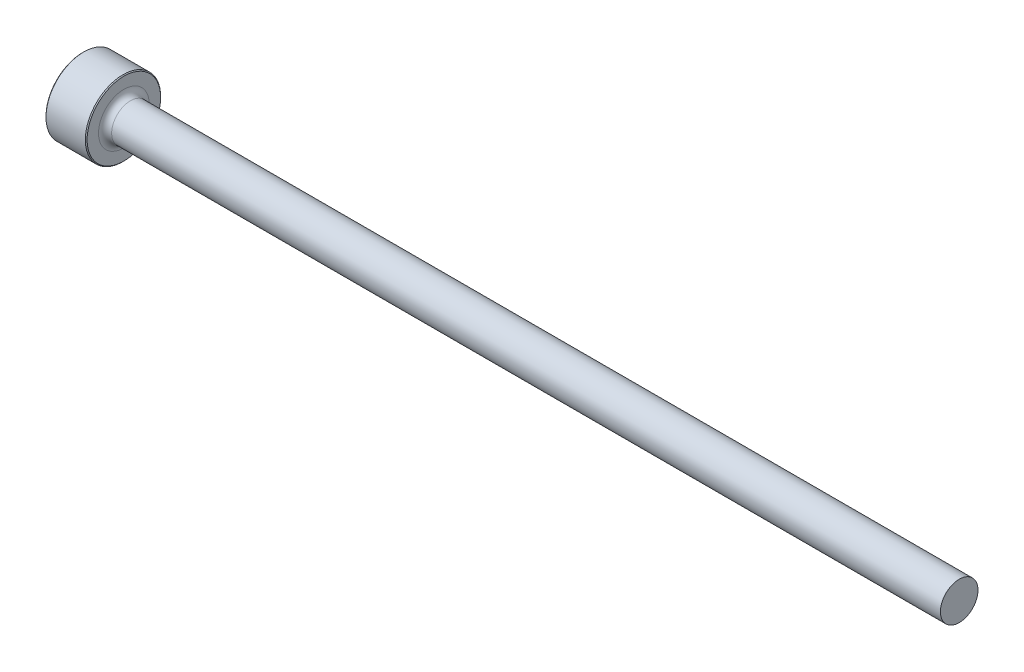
ISO-10303-21;
HEADER;
FILE_DESCRIPTION(('STEP AP214'),'2;1');
FILE_NAME('part.step','',(''),(''),'','','');
FILE_SCHEMA(('AUTOMOTIVE_DESIGN { 1 0 10303 214 1 1 1 1 }'));
ENDSEC;
DATA;
#1=APPLICATION_CONTEXT('core data for automotive mechanical design processes');
#2=APPLICATION_PROTOCOL_DEFINITION('international standard','automotive_design',2000,#1);
#3=PRODUCT_CONTEXT('',#1,'mechanical');
#4=PRODUCT('Part','Part','',(#3));
#5=PRODUCT_RELATED_PRODUCT_CATEGORY('part','',(#4));
#6=PRODUCT_DEFINITION_FORMATION('','',#4);
#7=PRODUCT_DEFINITION_CONTEXT('part definition',#1,'design');
#8=PRODUCT_DEFINITION('design','',#6,#7);
#9=PRODUCT_DEFINITION_SHAPE('','',#8);
#10=(LENGTH_UNIT() NAMED_UNIT(*) SI_UNIT(.MILLI.,.METRE.));
#11=(NAMED_UNIT(*) PLANE_ANGLE_UNIT() SI_UNIT($,.RADIAN.));
#12=(NAMED_UNIT(*) SI_UNIT($,.STERADIAN.) SOLID_ANGLE_UNIT());
#13=UNCERTAINTY_MEASURE_WITH_UNIT(LENGTH_MEASURE(1.E-05),#10,'distance_accuracy_value','');
#14=(GEOMETRIC_REPRESENTATION_CONTEXT(3) GLOBAL_UNCERTAINTY_ASSIGNED_CONTEXT((#13)) GLOBAL_UNIT_ASSIGNED_CONTEXT((#10,
#11,#12)) REPRESENTATION_CONTEXT('',''));
#15=CARTESIAN_POINT('',(0.,0.,0.));
#16=DIRECTION('',(0.,0.,1.));
#17=DIRECTION('',(1.,0.,0.));
#18=AXIS2_PLACEMENT_3D('',#15,#16,#17);
#19=CARTESIAN_POINT('',(101.6,2.17900249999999,0.));
#20=DIRECTION('',(1.,0.,0.));
#21=DIRECTION('',(0.,1.,0.));
#22=AXIS2_PLACEMENT_3D('',#19,#20,#21);
#23=PLANE('',#22);
#24=CARTESIAN_POINT('',(101.6,0.,0.));
#25=DIRECTION('',(1.,0.,0.));
#26=DIRECTION('',(0.,1.,0.));
#27=AXIS2_PLACEMENT_3D('',#24,#25,#26);
#28=CIRCLE('',#27,2.1790025);
#29=CARTESIAN_POINT('',(101.6,2.17900249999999,0.));
#30=VERTEX_POINT('',#29);
#31=EDGE_CURVE('E50',#30,#30,#28,.T.);
#32=ORIENTED_EDGE('',*,*,#31,.T.);
#33=EDGE_LOOP('',(#32));
#34=FACE_BOUND('',#33,.T.);
#35=ADVANCED_FACE('F30',(#34),#23,.T.);
#36=CARTESIAN_POINT('',(101.6,0.,0.));
#37=DIRECTION('',(1.,0.,0.));
#38=DIRECTION('',(0.,1.,0.));
#39=AXIS2_PLACEMENT_3D('',#36,#37,#38);
#40=CYLINDRICAL_SURFACE('',#39,2.1790025);
#41=CARTESIAN_POINT('',(5.5245,0.,0.));
#42=DIRECTION('',(1.,0.,0.));
#43=DIRECTION('',(0.,1.,0.));
#44=AXIS2_PLACEMENT_3D('',#41,#42,#43);
#45=CIRCLE('',#44,2.17900249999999);
#46=CARTESIAN_POINT('',(5.5245,2.17900249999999,0.));
#47=VERTEX_POINT('',#46);
#48=EDGE_CURVE('E53',#47,#47,#45,.T.);
#49=ORIENTED_EDGE('',*,*,#48,.T.);
#50=EDGE_LOOP('',(#49));
#51=FACE_BOUND('',#50,.T.);
#52=ORIENTED_EDGE('',*,*,#31,.F.);
#53=EDGE_LOOP('',(#52));
#54=FACE_BOUND('',#53,.T.);
#55=ADVANCED_FACE('F74',(#51,#54),#40,.T.);
#56=CARTESIAN_POINT('',(5.5245,0.,0.));
#57=DIRECTION('',(1.,0.,0.));
#58=DIRECTION('',(0.,1.,0.));
#59=AXIS2_PLACEMENT_3D('',#56,#57,#58);
#60=TOROIDAL_SURFACE('',#59,2.94100249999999,0.762);
#61=CARTESIAN_POINT('',(4.7625,0.,0.));
#62=DIRECTION('',(1.,0.,0.));
#63=DIRECTION('',(0.,1.,0.));
#64=AXIS2_PLACEMENT_3D('',#61,#62,#63);
#65=CIRCLE('',#64,2.94100249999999);
#66=CARTESIAN_POINT('',(4.7625,2.94100249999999,0.));
#67=VERTEX_POINT('',#66);
#68=EDGE_CURVE('E56',#67,#67,#65,.T.);
#69=ORIENTED_EDGE('',*,*,#68,.T.);
#70=EDGE_LOOP('',(#69));
#71=FACE_BOUND('',#70,.T.);
#72=ORIENTED_EDGE('',*,*,#48,.F.);
#73=EDGE_LOOP('',(#72));
#74=FACE_BOUND('',#73,.T.);
#75=ADVANCED_FACE('F60',(#71,#74),#60,.F.);
#76=CARTESIAN_POINT('',(4.7625,4.365625,0.));
#77=DIRECTION('',(1.,0.,0.));
#78=DIRECTION('',(0.,1.,0.));
#79=AXIS2_PLACEMENT_3D('',#76,#77,#78);
#80=PLANE('',#79);
#81=CARTESIAN_POINT('',(4.7625,0.,0.));
#82=DIRECTION('',(1.,0.,0.));
#83=DIRECTION('',(0.,1.,0.));
#84=AXIS2_PLACEMENT_3D('',#81,#82,#83);
#85=CIRCLE('',#84,4.26402499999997);
#86=CARTESIAN_POINT('',(4.7625,4.26402499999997,0.));
#87=VERTEX_POINT('',#86);
#88=EDGE_CURVE('E10',#87,#87,#85,.T.);
#89=ORIENTED_EDGE('',*,*,#88,.T.);
#90=EDGE_LOOP('',(#89));
#91=FACE_BOUND('',#90,.T.);
#92=ORIENTED_EDGE('',*,*,#68,.F.);
#93=EDGE_LOOP('',(#92));
#94=FACE_BOUND('',#93,.T.);
#95=ADVANCED_FACE('F63',(#91,#94),#80,.T.);
#96=CARTESIAN_POINT('',(101.6,0.,0.));
#97=DIRECTION('',(1.,0.,0.));
#98=DIRECTION('',(0.,1.,0.));
#99=AXIS2_PLACEMENT_3D('',#96,#97,#98);
#100=CYLINDRICAL_SURFACE('',#99,4.365625);
#101=CARTESIAN_POINT('',(0.101599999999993,0.,0.));
#102=DIRECTION('',(-1.,0.,0.));
#103=DIRECTION('',(0.,-1.,0.));
#104=AXIS2_PLACEMENT_3D('',#101,#102,#103);
#105=CIRCLE('',#104,4.365625);
#106=CARTESIAN_POINT('',(0.101599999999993,-4.365625,0.));
#107=VERTEX_POINT('',#106);
#108=EDGE_CURVE('E41',#107,#107,#105,.F.);
#109=ORIENTED_EDGE('',*,*,#108,.T.);
#110=EDGE_LOOP('',(#109));
#111=FACE_BOUND('',#110,.T.);
#112=CARTESIAN_POINT('',(4.66089999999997,0.,0.));
#113=DIRECTION('',(1.,0.,0.));
#114=DIRECTION('',(0.,1.,0.));
#115=AXIS2_PLACEMENT_3D('',#112,#113,#114);
#116=CIRCLE('',#115,4.365625);
#117=CARTESIAN_POINT('',(4.66089999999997,4.365625,0.));
#118=VERTEX_POINT('',#117);
#119=EDGE_CURVE('E45',#118,#118,#116,.F.);
#120=ORIENTED_EDGE('',*,*,#119,.T.);
#121=EDGE_LOOP('',(#120));
#122=FACE_BOUND('',#121,.T.);
#123=ADVANCED_FACE('F65',(#111,#122),#100,.T.);
#124=CARTESIAN_POINT('',(0.,0.,0.));
#125=DIRECTION('',(-1.,0.,0.));
#126=DIRECTION('',(0.,-1.,0.));
#127=AXIS2_PLACEMENT_3D('',#124,#125,#126);
#128=PLANE('',#127);
#129=CARTESIAN_POINT('',(0.,0.,0.));
#130=DIRECTION('',(-1.,0.,0.));
#131=DIRECTION('',(0.,-1.,0.));
#132=AXIS2_PLACEMENT_3D('',#129,#130,#131);
#133=CIRCLE('',#132,4.26402500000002);
#134=CARTESIAN_POINT('',(0.,-4.26402500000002,0.));
#135=VERTEX_POINT('',#134);
#136=EDGE_CURVE('E37',#135,#135,#133,.T.);
#137=ORIENTED_EDGE('',*,*,#136,.T.);
#138=EDGE_LOOP('',(#137));
#139=FACE_BOUND('',#138,.T.);
#140=ADVANCED_FACE('F71',(#139),#128,.T.);
#141=CARTESIAN_POINT('',(0.101599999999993,0.,0.));
#142=DIRECTION('',(1.,0.,0.));
#143=DIRECTION('',(0.,1.,0.));
#144=AXIS2_PLACEMENT_3D('',#141,#142,#143);
#145=CONICAL_SURFACE('',#144,4.365625,0.785398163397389);
#146=ORIENTED_EDGE('',*,*,#136,.F.);
#147=EDGE_LOOP('',(#146));
#148=FACE_BOUND('',#147,.T.);
#149=ORIENTED_EDGE('',*,*,#108,.F.);
#150=EDGE_LOOP('',(#149));
#151=FACE_BOUND('',#150,.T.);
#152=ADVANCED_FACE('F84',(#148,#151),#145,.T.);
#153=CARTESIAN_POINT('',(4.7625,0.,0.));
#154=DIRECTION('',(-1.,0.,0.));
#155=DIRECTION('',(0.,-1.,0.));
#156=AXIS2_PLACEMENT_3D('',#153,#154,#155);
#157=CONICAL_SURFACE('',#156,4.26402499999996,0.785398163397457);
#158=ORIENTED_EDGE('',*,*,#119,.F.);
#159=EDGE_LOOP('',(#158));
#160=FACE_BOUND('',#159,.T.);
#161=ORIENTED_EDGE('',*,*,#88,.F.);
#162=EDGE_LOOP('',(#161));
#163=FACE_BOUND('',#162,.T.);
#164=ADVANCED_FACE('F32',(#160,#163),#157,.T.);
#165=CLOSED_SHELL('',(#35,#55,#75,#95,#123,#140,#152,#164));
#166=MANIFOLD_SOLID_BREP('B2',#165);
#167=ADVANCED_BREP_SHAPE_REPRESENTATION('',(#18,#166),#14);
#168=SHAPE_DEFINITION_REPRESENTATION(#9,#167);
ENDSEC;
END-ISO-10303-21;
